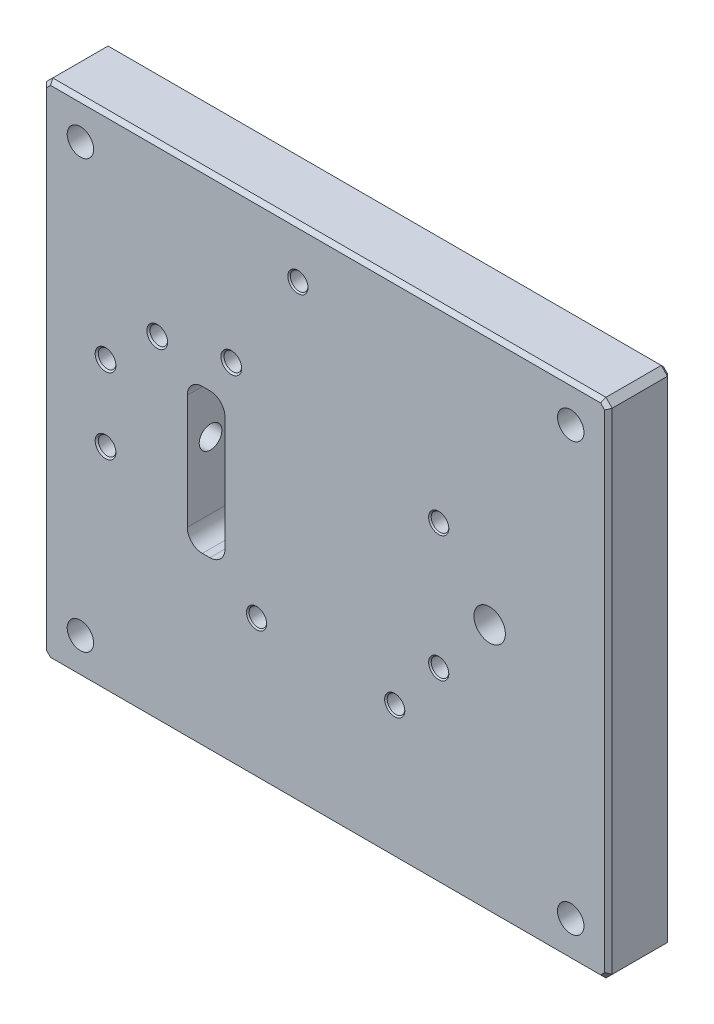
from build123d import *

# Parameters (mm, degrees)
ESQUISSE1_R                                  = 10.5
VOLUME_DEPTH                                 = 50
TROUS_TARAUD_S_M16_PONCTUELLES_D             = 14
TROUS_TARAUD_S_M16_PONCTUELLES_DEPTH         = 35
TROUS_TARAUD_S_M16_PONCTUELLES_CSINK_D       = 16.05
TROUS_TARAUD_S_M16_PONCTUELLES_CSINK_ANGLE   = 90
TROUS_TARAUD_S_M16_PONCTUELLES_TIP           = 4.206024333
ESQUISSE25_R                                 = 12.5
CIMBLOT_LAMAGE_DEPTH                         = 18
LOGEMENT_PALONNIER_DEPTH                     = 38
AXE_PALONNIER_PER_AGE_17_5_D                 = 17.5
AXE_PALONNIER_PER_AGE_17_5_DEPTH             = 170
AXE_PALONNIER_PER_AGE_17_5_TIP               = 5.257530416
AXE_PLONNIER_AL_SAGE_18_DEPTH                = 495.974746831
AXE_PLONNIER_AL_SAGE_18_DEPTH_BACK           = 40
AXE_PLONNIER_AL_SAGE_18_START                = -145
ESQUISSE15_R                                 = 9
TARAUDAGES_M16_PR_POSITIONNEUR_D             = 14
TARAUDAGES_M16_PR_POSITIONNEUR_DEPTH         = 42
TARAUDAGES_M16_PR_POSITIONNEUR_CSINK_D       = 16.05
TARAUDAGES_M16_PR_POSITIONNEUR_CSINK_ANGLE   = 90
TARAUDAGES_M16_PR_POSITIONNEUR_TIP           = 4.206024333
TROU_TARAUD_M16_D                            = 14
TROU_TARAUD_M16_DEPTH                        = 42
TROU_TARAUD_M16_CSINK_D                      = 16.05
TROU_TARAUD_M16_CSINK_ANGLE                  = 90
TROU_TARAUD_M16_TIP                          = 4.206024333
TROU_TARAUD_M16_SUPPORTS_SERRAGE_D           = 14
TROU_TARAUD_M16_SUPPORTS_SERRAGE_DEPTH       = 40
TROU_TARAUD_M16_SUPPORTS_SERRAGE_CSINK_D     = 16.5
TROU_TARAUD_M16_SUPPORTS_SERRAGE_CSINK_ANGLE = 90
TROU_TARAUD_M16_SUPPORTS_SERRAGE_TIP         = 4.206024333
CHANFREIN1_SIZE                              = 3


with BuildPart() as part:
    # Esquisse1 → Volume (new body)
    with BuildSketch(Plane(origin=(0, -20, 0), x_dir=(1, 0, 0), z_dir=(0, 0, -1))):
        Polygon((-280, -215), (-275, -220), (165, -220), (170, -215), (170, 175), (165, 180), (-275, 180), (-280, 175), align=None)
        with Locations((-250, 150)):
            Circle(ESQUISSE1_R, mode=Mode.SUBTRACT)
        with Locations((140, 150)):
            Circle(ESQUISSE1_R, mode=Mode.SUBTRACT)
        with Locations((-250, -190)):
            Circle(ESQUISSE1_R, mode=Mode.SUBTRACT)
        with Locations((140, -190)):
            Circle(ESQUISSE1_R, mode=Mode.SUBTRACT)
    extrude(amount=VOLUME_DEPTH)

    # Trous taraud_s M16 ponctuelles
    with Locations(Plane(origin=(35, 50, 0), x_dir=(1, 0, 0), z_dir=(0, 0, 1))):
        with Locations((0, 0), (0, -100)):
            CounterSinkHole(TROUS_TARAUD_S_M16_PONCTUELLES_D / 2, TROUS_TARAUD_S_M16_PONCTUELLES_CSINK_D / 2, depth=TROUS_TARAUD_S_M16_PONCTUELLES_DEPTH, counter_sink_angle=TROUS_TARAUD_S_M16_PONCTUELLES_CSINK_ANGLE)
            with Locations((0, 0, -(TROUS_TARAUD_S_M16_PONCTUELLES_DEPTH + TROUS_TARAUD_S_M16_PONCTUELLES_TIP / 2))):  # 118° drill point
                Cone(0, TROUS_TARAUD_S_M16_PONCTUELLES_D / 2, TROUS_TARAUD_S_M16_PONCTUELLES_TIP, mode=Mode.SUBTRACT)

    # Esquisse23 → Cimblot - Chambrage vis M16 (revolve, cut)
    with BuildSketch(Plane(origin=(75.502, 0, -50), x_dir=(0, 1, 0), z_dir=(1, 0, 0))):
        Polygon((0, 0), (0, 50), (9, 50), (8.75, 49.75), (8.75, 16), (13, 16), (13, 0.75), (13.75, 0), align=None)
    revolve(axis=Axis((75.502, 0, -56.35), (0, 0, 1)), mode=Mode.SUBTRACT)

    # Esquisse25 → Cimblot - Lamage (cut)
    with BuildSketch(Plane.XY):
        with Locations((75.502, 0)):
            Circle(ESQUISSE25_R)
    extrude(amount=-CIMBLOT_LAMAGE_DEPTH, mode=Mode.SUBTRACT)

    # Esquisse18 → Logement palonnier (cut)
    with BuildSketch(Plane.XY):
        with BuildLine():
            Line((-153, 50), (-147, 50))
            ThreePointArc((-147, 50), (-138.514718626, 46.485281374), (-135, 38))
            Line((-135, 38), (-135, -53))
            ThreePointArc((-135, -53), (-138.514718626, -61.485281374), (-147, -65))
            Line((-147, -65), (-153, -65))
            ThreePointArc((-153, -65), (-161.485281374, -61.485281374), (-165, -53))
            Line((-165, -53), (-165, 38))
            ThreePointArc((-165, 38), (-161.485281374, 46.485281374), (-153, 50))
        make_face()
    extrude(amount=-LOGEMENT_PALONNIER_DEPTH, mode=Mode.SUBTRACT)

    # Axe palonnier per_age _17.5
    with Locations(Plane(origin=(-280, 0, -18.5), x_dir=(0, -1, 0), z_dir=(-1, 0, 0))):
        with Locations((0, 0)):
            Hole(AXE_PALONNIER_PER_AGE_17_5_D / 2, depth=AXE_PALONNIER_PER_AGE_17_5_DEPTH)
            with Locations((0, 0, -(AXE_PALONNIER_PER_AGE_17_5_DEPTH + AXE_PALONNIER_PER_AGE_17_5_TIP / 2))):  # 118° drill point
                Cone(0, AXE_PALONNIER_PER_AGE_17_5_D / 2, AXE_PALONNIER_PER_AGE_17_5_TIP, mode=Mode.SUBTRACT)

    # Esquisse15 → Axe plonnier al_sage _18 (cut, two sides: drawn at the far end of the back side and taken through both)
    with BuildSketch(Plane.ZY.offset(280).offset(AXE_PLONNIER_AL_SAGE_18_START - AXE_PLONNIER_AL_SAGE_18_DEPTH_BACK)):
        with Locations(Location((-18.5, 0, 0), (0, 0, 180))):
            Circle(ESQUISSE15_R)
    extrude(amount=AXE_PLONNIER_AL_SAGE_18_DEPTH + AXE_PLONNIER_AL_SAGE_18_DEPTH_BACK, mode=Mode.SUBTRACT)

    # Taraudages M16 pr_-positionneur
    with Locations(Plane(origin=(-109.886304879, -88, 0), x_dir=(1, 0, 0), z_dir=(0, 0, 1))):
        with Locations((0, 0), (109.886304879, -5)):
            CounterSinkHole(TARAUDAGES_M16_PR_POSITIONNEUR_D / 2, TARAUDAGES_M16_PR_POSITIONNEUR_CSINK_D / 2, depth=TARAUDAGES_M16_PR_POSITIONNEUR_DEPTH, counter_sink_angle=TARAUDAGES_M16_PR_POSITIONNEUR_CSINK_ANGLE)
            with Locations((0, 0, -(TARAUDAGES_M16_PR_POSITIONNEUR_DEPTH + TARAUDAGES_M16_PR_POSITIONNEUR_TIP / 2))):  # 118° drill point
                Cone(0, TARAUDAGES_M16_PR_POSITIONNEUR_D / 2, TARAUDAGES_M16_PR_POSITIONNEUR_TIP, mode=Mode.SUBTRACT)

    # Trou taraud_ M16
    with Locations(Plane(origin=(-77, 160, 0), x_dir=(1, 0, 0), z_dir=(0, 0, 1))):
        with Locations((0, 0)):
            CounterSinkHole(TROU_TARAUD_M16_D / 2, TROU_TARAUD_M16_CSINK_D / 2, depth=TROU_TARAUD_M16_DEPTH, counter_sink_angle=TROU_TARAUD_M16_CSINK_ANGLE)
            with Locations((0, 0, -(TROU_TARAUD_M16_DEPTH + TROU_TARAUD_M16_TIP / 2))):  # 118° drill point
                Cone(0, TROU_TARAUD_M16_D / 2, TROU_TARAUD_M16_TIP, mode=Mode.SUBTRACT)

    # Trou taraud_ M16 - Supports serrage
    with Locations(Plane.XY):
        with Locations((-230, 30), (-130, 78), (-188.891628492, 66.520623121), (-230, -30)):
            CounterSinkHole(TROU_TARAUD_M16_SUPPORTS_SERRAGE_D / 2, TROU_TARAUD_M16_SUPPORTS_SERRAGE_CSINK_D / 2, depth=TROU_TARAUD_M16_SUPPORTS_SERRAGE_DEPTH, counter_sink_angle=TROU_TARAUD_M16_SUPPORTS_SERRAGE_CSINK_ANGLE)
            with Locations((0, 0, -(TROU_TARAUD_M16_SUPPORTS_SERRAGE_DEPTH + TROU_TARAUD_M16_SUPPORTS_SERRAGE_TIP / 2))):  # 118° drill point
                Cone(0, TROU_TARAUD_M16_SUPPORTS_SERRAGE_D / 2, TROU_TARAUD_M16_SUPPORTS_SERRAGE_TIP, mode=Mode.SUBTRACT)

    # Chanfrein1
    chanfrein1_edges = [part.edges().sort_by_distance(p)[0] for p in [
        (-55, 200, -50),
        (-277.5, 197.5, 0),
        (-280, 0, 0),
        (167.5, 197.5, -50),
        (170, 0, -50),
        (167.5, -197.5, -50),
        (-55, -200, -50),
        (-277.5, -197.5, -50),
        (-280, 0, -50),
        (-277.5, 197.5, -50),
        (-277.5, -197.5, 0),
        (-55, -200, 0),
        (167.5, -197.5, 0),
        (170, 0, 0),
        (167.5, 197.5, 0),
        (-55, 200, 0),
    ]]
    chamfer(chanfrein1_edges, length=CHANFREIN1_SIZE)


solid = part.part
